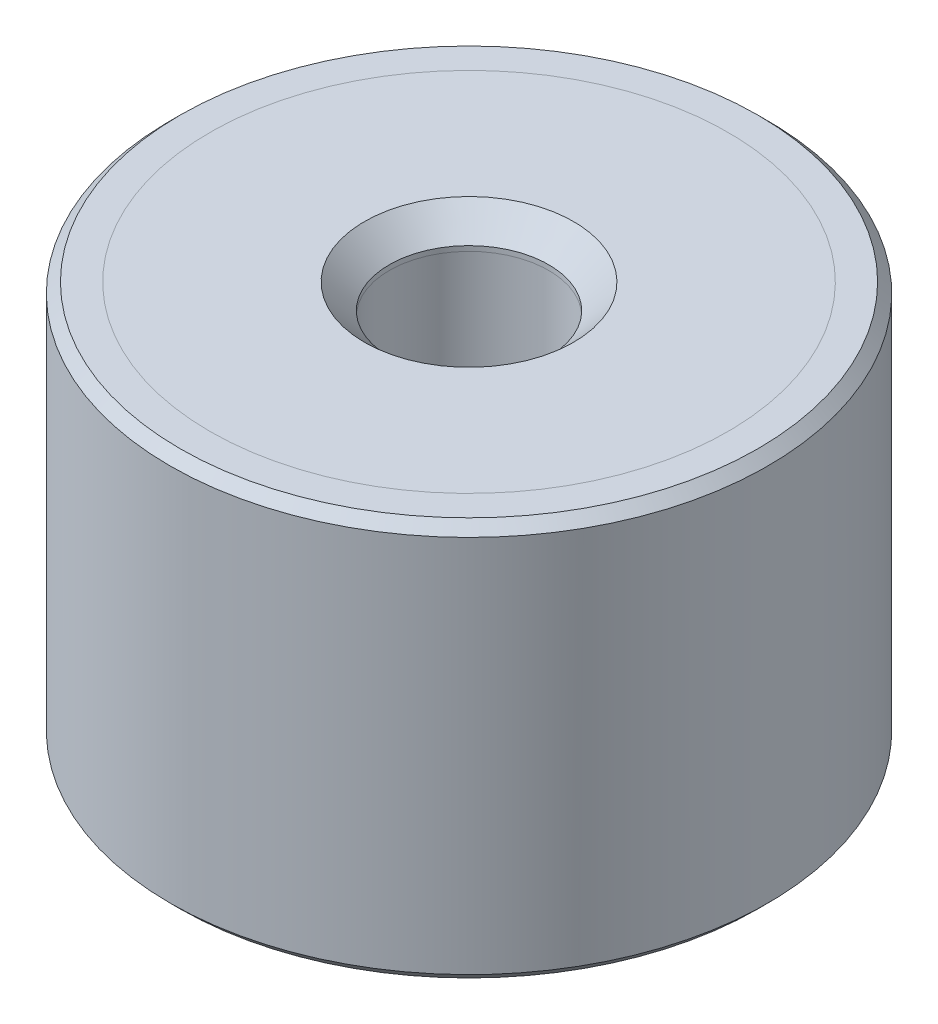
ISO-10303-21;
HEADER;
FILE_DESCRIPTION(('STEP AP214'),'2;1');
FILE_NAME('part.step','',(''),(''),'','','');
FILE_SCHEMA(('AUTOMOTIVE_DESIGN { 1 0 10303 214 1 1 1 1 }'));
ENDSEC;
DATA;
#1=APPLICATION_CONTEXT('core data for automotive mechanical design processes');
#2=APPLICATION_PROTOCOL_DEFINITION('international standard','automotive_design',2000,#1);
#3=PRODUCT_CONTEXT('',#1,'mechanical');
#4=PRODUCT('Part','Part','',(#3));
#5=PRODUCT_RELATED_PRODUCT_CATEGORY('part','',(#4));
#6=PRODUCT_DEFINITION_FORMATION('','',#4);
#7=PRODUCT_DEFINITION_CONTEXT('part definition',#1,'design');
#8=PRODUCT_DEFINITION('design','',#6,#7);
#9=PRODUCT_DEFINITION_SHAPE('','',#8);
#10=(LENGTH_UNIT() NAMED_UNIT(*) SI_UNIT(.MILLI.,.METRE.));
#11=(NAMED_UNIT(*) PLANE_ANGLE_UNIT() SI_UNIT($,.RADIAN.));
#12=(NAMED_UNIT(*) SI_UNIT($,.STERADIAN.) SOLID_ANGLE_UNIT());
#13=UNCERTAINTY_MEASURE_WITH_UNIT(LENGTH_MEASURE(1.E-05),#10,'distance_accuracy_value','');
#14=(GEOMETRIC_REPRESENTATION_CONTEXT(3) GLOBAL_UNCERTAINTY_ASSIGNED_CONTEXT((#13)) GLOBAL_UNIT_ASSIGNED_CONTEXT((#10,
#11,#12)) REPRESENTATION_CONTEXT('',''));
#15=CARTESIAN_POINT('',(0.,0.,0.));
#16=DIRECTION('',(0.,0.,1.));
#17=DIRECTION('',(1.,0.,0.));
#18=AXIS2_PLACEMENT_3D('',#15,#16,#17);
#19=CARTESIAN_POINT('',(0.,51.0340428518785,0.));
#20=DIRECTION('',(0.,1.,0.));
#21=DIRECTION('',(0.,0.,1.));
#22=AXIS2_PLACEMENT_3D('',#19,#20,#21);
#23=CYLINDRICAL_SURFACE('',#22,4.);
#24=CARTESIAN_POINT('',(0.,-17.25,0.));
#25=DIRECTION('',(0.,-1.,0.));
#26=DIRECTION('',(0.,0.,-1.));
#27=AXIS2_PLACEMENT_3D('',#24,#25,#26);
#28=CIRCLE('',#27,4.);
#29=CARTESIAN_POINT('',(0.,-17.25,-4.));
#30=VERTEX_POINT('',#29);
#31=EDGE_CURVE('P0_E10',#30,#30,#28,.T.);
#32=ORIENTED_EDGE('',*,*,#31,.T.);
#33=EDGE_LOOP('',(#32));
#34=FACE_BOUND('',#33,.T.);
#35=CARTESIAN_POINT('',(0.,-17.,0.));
#36=DIRECTION('',(0.,1.,0.));
#37=DIRECTION('',(0.,0.,1.));
#38=AXIS2_PLACEMENT_3D('',#35,#36,#37);
#39=CIRCLE('',#38,4.);
#40=CARTESIAN_POINT('',(0.,-17.,4.));
#41=VERTEX_POINT('',#40);
#42=EDGE_CURVE('P0_E25',#41,#41,#39,.T.);
#43=ORIENTED_EDGE('',*,*,#42,.T.);
#44=EDGE_LOOP('',(#43));
#45=FACE_BOUND('',#44,.T.);
#46=ADVANCED_FACE('P0_F14',(#34,#45),#23,.F.);
#47=CARTESIAN_POINT('',(0.,-17.,4.));
#48=DIRECTION('',(0.,1.,0.));
#49=DIRECTION('',(0.,0.,1.));
#50=AXIS2_PLACEMENT_3D('',#47,#48,#49);
#51=PLANE('',#50);
#52=CARTESIAN_POINT('',(0.,-17.,0.));
#53=DIRECTION('',(0.,1.,0.));
#54=DIRECTION('',(0.,0.,1.));
#55=AXIS2_PLACEMENT_3D('',#52,#53,#54);
#56=CIRCLE('',#55,13.);
#57=CARTESIAN_POINT('',(0.,-17.,13.));
#58=VERTEX_POINT('',#57);
#59=EDGE_CURVE('P0_E29',#58,#58,#56,.T.);
#60=ORIENTED_EDGE('',*,*,#59,.T.);
#61=EDGE_LOOP('',(#60));
#62=FACE_BOUND('',#61,.T.);
#63=ORIENTED_EDGE('',*,*,#42,.F.);
#64=EDGE_LOOP('',(#63));
#65=FACE_BOUND('',#64,.T.);
#66=ADVANCED_FACE('P0_F50',(#62,#65),#51,.T.);
#67=CARTESIAN_POINT('',(0.,51.0340428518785,0.));
#68=DIRECTION('',(0.,1.,0.));
#69=DIRECTION('',(0.,0.,1.));
#70=AXIS2_PLACEMENT_3D('',#67,#68,#69);
#71=CYLINDRICAL_SURFACE('',#70,13.);
#72=CARTESIAN_POINT('',(0.,-18.5,0.));
#73=DIRECTION('',(0.,1.,0.));
#74=DIRECTION('',(0.,0.,1.));
#75=AXIS2_PLACEMENT_3D('',#72,#73,#74);
#76=CIRCLE('',#75,13.);
#77=CARTESIAN_POINT('',(0.,-18.5,13.));
#78=VERTEX_POINT('',#77);
#79=EDGE_CURVE('P0_E34',#78,#78,#76,.T.);
#80=ORIENTED_EDGE('',*,*,#79,.T.);
#81=EDGE_LOOP('',(#80));
#82=FACE_BOUND('',#81,.T.);
#83=ORIENTED_EDGE('',*,*,#59,.F.);
#84=EDGE_LOOP('',(#83));
#85=FACE_BOUND('',#84,.T.);
#86=ADVANCED_FACE('P0_F38',(#82,#85),#71,.T.);
#87=CARTESIAN_POINT('',(0.,-18.5,13.));
#88=DIRECTION('',(0.,-1.,0.));
#89=DIRECTION('',(0.,0.,-1.));
#90=AXIS2_PLACEMENT_3D('',#87,#88,#89);
#91=PLANE('',#90);
#92=CARTESIAN_POINT('',(0.,-18.5,0.));
#93=DIRECTION('',(0.,-1.,0.));
#94=DIRECTION('',(0.,0.,-1.));
#95=AXIS2_PLACEMENT_3D('',#92,#93,#94);
#96=CIRCLE('',#95,5.25);
#97=CARTESIAN_POINT('',(0.,-18.5,-5.25));
#98=VERTEX_POINT('',#97);
#99=EDGE_CURVE('P0_E21',#98,#98,#96,.F.);
#100=ORIENTED_EDGE('',*,*,#99,.T.);
#101=EDGE_LOOP('',(#100));
#102=FACE_BOUND('',#101,.T.);
#103=ORIENTED_EDGE('',*,*,#79,.F.);
#104=EDGE_LOOP('',(#103));
#105=FACE_BOUND('',#104,.T.);
#106=ADVANCED_FACE('P0_F41',(#102,#105),#91,.T.);
#107=CARTESIAN_POINT('',(0.,-18.5,0.));
#108=DIRECTION('',(0.,-1.,0.));
#109=DIRECTION('',(0.,0.,-1.));
#110=AXIS2_PLACEMENT_3D('',#107,#108,#109);
#111=CONICAL_SURFACE('',#110,5.25,0.785398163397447);
#112=ORIENTED_EDGE('',*,*,#31,.F.);
#113=EDGE_LOOP('',(#112));
#114=FACE_BOUND('',#113,.T.);
#115=ORIENTED_EDGE('',*,*,#99,.F.);
#116=EDGE_LOOP('',(#115));
#117=FACE_BOUND('',#116,.T.);
#118=ADVANCED_FACE('P0_F16',(#114,#117),#111,.F.);
#119=CLOSED_SHELL('',(#46,#66,#86,#106,#118));
#120=MANIFOLD_SOLID_BREP('P0_B1',#119);
#121=CARTESIAN_POINT('',(0.,69.5340428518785,0.));
#122=DIRECTION('',(0.,1.,0.));
#123=DIRECTION('',(0.,0.,1.));
#124=AXIS2_PLACEMENT_3D('',#121,#122,#123);
#125=CYLINDRICAL_SURFACE('',#124,4.);
#126=CARTESIAN_POINT('',(0.,0.249999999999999,0.));
#127=DIRECTION('',(0.,1.,0.));
#128=DIRECTION('',(0.,0.,1.));
#129=AXIS2_PLACEMENT_3D('',#126,#127,#128);
#130=CIRCLE('',#129,4.);
#131=CARTESIAN_POINT('',(0.,0.249999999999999,4.));
#132=VERTEX_POINT('',#131);
#133=EDGE_CURVE('P1_E21',#132,#132,#130,.T.);
#134=ORIENTED_EDGE('',*,*,#133,.T.);
#135=EDGE_LOOP('',(#134));
#136=FACE_BOUND('',#135,.T.);
#137=CARTESIAN_POINT('',(0.,0.,0.));
#138=DIRECTION('',(0.,1.,0.));
#139=DIRECTION('',(0.,0.,1.));
#140=AXIS2_PLACEMENT_3D('',#137,#138,#139);
#141=CIRCLE('',#140,4.);
#142=CARTESIAN_POINT('',(0.,0.,4.));
#143=VERTEX_POINT('',#142);
#144=EDGE_CURVE('P1_E34',#143,#143,#141,.T.);
#145=ORIENTED_EDGE('',*,*,#144,.F.);
#146=EDGE_LOOP('',(#145));
#147=FACE_BOUND('',#146,.T.);
#148=ADVANCED_FACE('P1_F14',(#136,#147),#125,.F.);
#149=CARTESIAN_POINT('',(0.,1.5,4.));
#150=DIRECTION('',(0.,1.,0.));
#151=DIRECTION('',(0.,0.,1.));
#152=AXIS2_PLACEMENT_3D('',#149,#150,#151);
#153=PLANE('',#152);
#154=CARTESIAN_POINT('',(0.,1.5,0.));
#155=DIRECTION('',(0.,1.,0.));
#156=DIRECTION('',(0.,0.,1.));
#157=AXIS2_PLACEMENT_3D('',#154,#155,#156);
#158=CIRCLE('',#157,5.25);
#159=CARTESIAN_POINT('',(0.,1.5,5.25));
#160=VERTEX_POINT('',#159);
#161=EDGE_CURVE('P1_E10',#160,#160,#158,.F.);
#162=ORIENTED_EDGE('',*,*,#161,.T.);
#163=EDGE_LOOP('',(#162));
#164=FACE_BOUND('',#163,.T.);
#165=CARTESIAN_POINT('',(0.,1.5,0.));
#166=DIRECTION('',(0.,1.,0.));
#167=DIRECTION('',(0.,0.,1.));
#168=AXIS2_PLACEMENT_3D('',#165,#166,#167);
#169=CIRCLE('',#168,13.);
#170=CARTESIAN_POINT('',(0.,1.5,13.));
#171=VERTEX_POINT('',#170);
#172=EDGE_CURVE('P1_E25',#171,#171,#169,.T.);
#173=ORIENTED_EDGE('',*,*,#172,.T.);
#174=EDGE_LOOP('',(#173));
#175=FACE_BOUND('',#174,.T.);
#176=ADVANCED_FACE('P1_F42',(#164,#175),#153,.T.);
#177=CARTESIAN_POINT('',(0.,69.5340428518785,0.));
#178=DIRECTION('',(0.,1.,0.));
#179=DIRECTION('',(0.,0.,1.));
#180=AXIS2_PLACEMENT_3D('',#177,#178,#179);
#181=CYLINDRICAL_SURFACE('',#180,13.);
#182=CARTESIAN_POINT('',(0.,0.,0.));
#183=DIRECTION('',(0.,1.,0.));
#184=DIRECTION('',(0.,0.,1.));
#185=AXIS2_PLACEMENT_3D('',#182,#183,#184);
#186=CIRCLE('',#185,13.);
#187=CARTESIAN_POINT('',(0.,0.,13.));
#188=VERTEX_POINT('',#187);
#189=EDGE_CURVE('P1_E29',#188,#188,#186,.T.);
#190=ORIENTED_EDGE('',*,*,#189,.T.);
#191=EDGE_LOOP('',(#190));
#192=FACE_BOUND('',#191,.T.);
#193=ORIENTED_EDGE('',*,*,#172,.F.);
#194=EDGE_LOOP('',(#193));
#195=FACE_BOUND('',#194,.T.);
#196=ADVANCED_FACE('P1_F47',(#192,#195),#181,.T.);
#197=CARTESIAN_POINT('',(0.,0.,13.));
#198=DIRECTION('',(0.,-1.,0.));
#199=DIRECTION('',(0.,0.,-1.));
#200=AXIS2_PLACEMENT_3D('',#197,#198,#199);
#201=PLANE('',#200);
#202=ORIENTED_EDGE('',*,*,#144,.T.);
#203=EDGE_LOOP('',(#202));
#204=FACE_BOUND('',#203,.T.);
#205=ORIENTED_EDGE('',*,*,#189,.F.);
#206=EDGE_LOOP('',(#205));
#207=FACE_BOUND('',#206,.T.);
#208=ADVANCED_FACE('P1_F38',(#204,#207),#201,.T.);
#209=CARTESIAN_POINT('',(0.,0.249999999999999,0.));
#210=DIRECTION('',(0.,1.,0.));
#211=DIRECTION('',(0.,0.,1.));
#212=AXIS2_PLACEMENT_3D('',#209,#210,#211);
#213=CONICAL_SURFACE('',#212,4.,0.785398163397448);
#214=ORIENTED_EDGE('',*,*,#161,.F.);
#215=EDGE_LOOP('',(#214));
#216=FACE_BOUND('',#215,.T.);
#217=ORIENTED_EDGE('',*,*,#133,.F.);
#218=EDGE_LOOP('',(#217));
#219=FACE_BOUND('',#218,.T.);
#220=ADVANCED_FACE('P1_F16',(#216,#219),#213,.F.);
#221=CLOSED_SHELL('',(#148,#176,#196,#208,#220));
#222=MANIFOLD_SOLID_BREP('P1_B1',#221);
#223=CARTESIAN_POINT('',(0.,0.,0.));
#224=DIRECTION('',(0.,1.,0.));
#225=DIRECTION('',(0.,0.,1.));
#226=AXIS2_PLACEMENT_3D('',#223,#224,#225);
#227=PLANE('',#226);
#228=CARTESIAN_POINT('',(0.,0.,0.));
#229=DIRECTION('',(0.,1.,0.));
#230=DIRECTION('',(0.,0.,1.));
#231=AXIS2_PLACEMENT_3D('',#228,#229,#230);
#232=CIRCLE('',#231,4.);
#233=CARTESIAN_POINT('',(0.,0.,4.));
#234=VERTEX_POINT('',#233);
#235=EDGE_CURVE('P2_E46',#234,#234,#232,.T.);
#236=ORIENTED_EDGE('',*,*,#235,.F.);
#237=EDGE_LOOP('',(#236));
#238=FACE_BOUND('',#237,.T.);
#239=CARTESIAN_POINT('',(0.,0.,0.));
#240=DIRECTION('',(0.,1.,0.));
#241=DIRECTION('',(0.,0.,1.));
#242=AXIS2_PLACEMENT_3D('',#239,#240,#241);
#243=CIRCLE('',#242,13.);
#244=CARTESIAN_POINT('',(0.,0.,13.));
#245=VERTEX_POINT('',#244);
#246=EDGE_CURVE('P2_E33',#245,#245,#243,.T.);
#247=ORIENTED_EDGE('',*,*,#246,.T.);
#248=EDGE_LOOP('',(#247));
#249=FACE_BOUND('',#248,.T.);
#250=ADVANCED_FACE('P2_F13',(#238,#249),#227,.T.);
#251=CARTESIAN_POINT('',(0.,65.5134936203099,0.));
#252=DIRECTION('',(0.,1.,0.));
#253=DIRECTION('',(0.,0.,1.));
#254=AXIS2_PLACEMENT_3D('',#251,#252,#253);
#255=CYLINDRICAL_SURFACE('',#254,13.);
#256=CARTESIAN_POINT('',(0.,1.5,0.));
#257=DIRECTION('',(0.,1.,0.));
#258=DIRECTION('',(0.,0.,1.));
#259=AXIS2_PLACEMENT_3D('',#256,#257,#258);
#260=CIRCLE('',#259,13.);
#261=CARTESIAN_POINT('',(0.,1.5,13.));
#262=VERTEX_POINT('',#261);
#263=EDGE_CURVE('P2_E36',#262,#262,#260,.T.);
#264=ORIENTED_EDGE('',*,*,#263,.T.);
#265=EDGE_LOOP('',(#264));
#266=FACE_BOUND('',#265,.T.);
#267=ORIENTED_EDGE('',*,*,#246,.F.);
#268=EDGE_LOOP('',(#267));
#269=FACE_BOUND('',#268,.T.);
#270=ADVANCED_FACE('P2_F92',(#266,#269),#255,.F.);
#271=CARTESIAN_POINT('',(0.,1.5,13.));
#272=DIRECTION('',(0.,1.,0.));
#273=DIRECTION('',(0.,0.,1.));
#274=AXIS2_PLACEMENT_3D('',#271,#272,#273);
#275=PLANE('',#274);
#276=CARTESIAN_POINT('',(0.,1.5,0.));
#277=DIRECTION('',(0.,1.,0.));
#278=DIRECTION('',(0.,0.,1.));
#279=AXIS2_PLACEMENT_3D('',#276,#277,#278);
#280=CIRCLE('',#279,14.5);
#281=CARTESIAN_POINT('',(0.,1.5,14.5));
#282=VERTEX_POINT('',#281);
#283=EDGE_CURVE('P2_E9',#282,#282,#280,.T.);
#284=ORIENTED_EDGE('',*,*,#283,.T.);
#285=EDGE_LOOP('',(#284));
#286=FACE_BOUND('',#285,.T.);
#287=ORIENTED_EDGE('',*,*,#263,.F.);
#288=EDGE_LOOP('',(#287));
#289=FACE_BOUND('',#288,.T.);
#290=ADVANCED_FACE('P2_F88',(#286,#289),#275,.T.);
#291=CARTESIAN_POINT('',(0.,65.5134936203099,0.));
#292=DIRECTION('',(0.,1.,0.));
#293=DIRECTION('',(0.,0.,1.));
#294=AXIS2_PLACEMENT_3D('',#291,#292,#293);
#295=CYLINDRICAL_SURFACE('',#294,15.);
#296=CARTESIAN_POINT('',(0.,-18.,0.));
#297=DIRECTION('',(0.,-1.,0.));
#298=DIRECTION('',(0.,0.,-1.));
#299=AXIS2_PLACEMENT_3D('',#296,#297,#298);
#300=CIRCLE('',#299,15.);
#301=CARTESIAN_POINT('',(0.,-18.,-15.));
#302=VERTEX_POINT('',#301);
#303=EDGE_CURVE('P2_E24',#302,#302,#300,.F.);
#304=ORIENTED_EDGE('',*,*,#303,.T.);
#305=EDGE_LOOP('',(#304));
#306=FACE_BOUND('',#305,.T.);
#307=CARTESIAN_POINT('',(0.,1.,0.));
#308=DIRECTION('',(0.,1.,0.));
#309=DIRECTION('',(0.,0.,1.));
#310=AXIS2_PLACEMENT_3D('',#307,#308,#309);
#311=CIRCLE('',#310,15.);
#312=CARTESIAN_POINT('',(0.,1.,15.));
#313=VERTEX_POINT('',#312);
#314=EDGE_CURVE('P2_E28',#313,#313,#311,.F.);
#315=ORIENTED_EDGE('',*,*,#314,.T.);
#316=EDGE_LOOP('',(#315));
#317=FACE_BOUND('',#316,.T.);
#318=ADVANCED_FACE('P2_F82',(#306,#317),#295,.T.);
#319=CARTESIAN_POINT('',(0.,-18.5,15.));
#320=DIRECTION('',(0.,-1.,0.));
#321=DIRECTION('',(0.,0.,-1.));
#322=AXIS2_PLACEMENT_3D('',#319,#320,#321);
#323=PLANE('',#322);
#324=CARTESIAN_POINT('',(0.,-18.5,0.));
#325=DIRECTION('',(0.,-1.,0.));
#326=DIRECTION('',(0.,0.,-1.));
#327=AXIS2_PLACEMENT_3D('',#324,#325,#326);
#328=CIRCLE('',#327,14.5);
#329=CARTESIAN_POINT('',(0.,-18.5,-14.5));
#330=VERTEX_POINT('',#329);
#331=EDGE_CURVE('P2_E20',#330,#330,#328,.T.);
#332=ORIENTED_EDGE('',*,*,#331,.T.);
#333=EDGE_LOOP('',(#332));
#334=FACE_BOUND('',#333,.T.);
#335=CARTESIAN_POINT('',(0.,-18.5,0.));
#336=DIRECTION('',(0.,1.,0.));
#337=DIRECTION('',(0.,0.,1.));
#338=AXIS2_PLACEMENT_3D('',#335,#336,#337);
#339=CIRCLE('',#338,13.);
#340=CARTESIAN_POINT('',(0.,-18.5,13.));
#341=VERTEX_POINT('',#340);
#342=EDGE_CURVE('P2_E39',#341,#341,#339,.T.);
#343=ORIENTED_EDGE('',*,*,#342,.T.);
#344=EDGE_LOOP('',(#343));
#345=FACE_BOUND('',#344,.T.);
#346=ADVANCED_FACE('P2_F77',(#334,#345),#323,.T.);
#347=CARTESIAN_POINT('',(0.,65.5134936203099,0.));
#348=DIRECTION('',(0.,1.,0.));
#349=DIRECTION('',(0.,0.,1.));
#350=AXIS2_PLACEMENT_3D('',#347,#348,#349);
#351=CYLINDRICAL_SURFACE('',#350,13.);
#352=CARTESIAN_POINT('',(0.,-17.,0.));
#353=DIRECTION('',(0.,1.,0.));
#354=DIRECTION('',(0.,0.,1.));
#355=AXIS2_PLACEMENT_3D('',#352,#353,#354);
#356=CIRCLE('',#355,13.);
#357=CARTESIAN_POINT('',(0.,-17.,13.));
#358=VERTEX_POINT('',#357);
#359=EDGE_CURVE('P2_E42',#358,#358,#356,.T.);
#360=ORIENTED_EDGE('',*,*,#359,.T.);
#361=EDGE_LOOP('',(#360));
#362=FACE_BOUND('',#361,.T.);
#363=ORIENTED_EDGE('',*,*,#342,.F.);
#364=EDGE_LOOP('',(#363));
#365=FACE_BOUND('',#364,.T.);
#366=ADVANCED_FACE('P2_F71',(#362,#365),#351,.F.);
#367=CARTESIAN_POINT('',(0.,-17.,13.));
#368=DIRECTION('',(0.,-1.,0.));
#369=DIRECTION('',(0.,0.,-1.));
#370=AXIS2_PLACEMENT_3D('',#367,#368,#369);
#371=PLANE('',#370);
#372=CARTESIAN_POINT('',(0.,-17.,0.));
#373=DIRECTION('',(0.,-1.,0.));
#374=DIRECTION('',(0.,0.,-1.));
#375=AXIS2_PLACEMENT_3D('',#372,#373,#374);
#376=CIRCLE('',#375,4.);
#377=CARTESIAN_POINT('',(0.,-17.,-4.));
#378=VERTEX_POINT('',#377);
#379=EDGE_CURVE('P2_E52',#378,#378,#376,.T.);
#380=ORIENTED_EDGE('',*,*,#379,.F.);
#381=EDGE_LOOP('',(#380));
#382=FACE_BOUND('',#381,.T.);
#383=ORIENTED_EDGE('',*,*,#359,.F.);
#384=EDGE_LOOP('',(#383));
#385=FACE_BOUND('',#384,.T.);
#386=ADVANCED_FACE('P2_F67',(#382,#385),#371,.T.);
#387=CARTESIAN_POINT('',(0.,-18.,0.));
#388=DIRECTION('',(0.,1.,0.));
#389=DIRECTION('',(0.,0.,1.));
#390=AXIS2_PLACEMENT_3D('',#387,#388,#389);
#391=CONICAL_SURFACE('',#390,15.,0.785398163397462);
#392=ORIENTED_EDGE('',*,*,#331,.F.);
#393=EDGE_LOOP('',(#392));
#394=FACE_BOUND('',#393,.T.);
#395=ORIENTED_EDGE('',*,*,#303,.F.);
#396=EDGE_LOOP('',(#395));
#397=FACE_BOUND('',#396,.T.);
#398=ADVANCED_FACE('P2_F70',(#394,#397),#391,.T.);
#399=CARTESIAN_POINT('',(0.,1.5,0.));
#400=DIRECTION('',(0.,-1.,0.));
#401=DIRECTION('',(0.,0.,-1.));
#402=AXIS2_PLACEMENT_3D('',#399,#400,#401);
#403=CONICAL_SURFACE('',#402,14.5,0.785398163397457);
#404=ORIENTED_EDGE('',*,*,#314,.F.);
#405=EDGE_LOOP('',(#404));
#406=FACE_BOUND('',#405,.T.);
#407=ORIENTED_EDGE('',*,*,#283,.F.);
#408=EDGE_LOOP('',(#407));
#409=FACE_BOUND('',#408,.T.);
#410=ADVANCED_FACE('P2_F15',(#406,#409),#403,.T.);
#411=CARTESIAN_POINT('',(0.,-6.5,0.));
#412=DIRECTION('',(0.,1.,0.));
#413=DIRECTION('',(0.,0.,1.));
#414=AXIS2_PLACEMENT_3D('',#411,#412,#413);
#415=CYLINDRICAL_SURFACE('',#414,4.);
#416=CARTESIAN_POINT('',(0.,-6.5,0.));
#417=DIRECTION('',(0.,1.,0.));
#418=DIRECTION('',(0.,0.,1.));
#419=AXIS2_PLACEMENT_3D('',#416,#417,#418);
#420=CIRCLE('',#419,4.);
#421=CARTESIAN_POINT('',(0.,-6.5,4.));
#422=VERTEX_POINT('',#421);
#423=EDGE_CURVE('P2_E45',#422,#422,#420,.T.);
#424=CARTESIAN_POINT('',(0.,-6.5,4.));
#425=CARTESIAN_POINT('',(0.,-6.43229166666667,4.));
#426=CARTESIAN_POINT('',(0.,-6.36458333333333,4.));
#427=CARTESIAN_POINT('',(0.,-6.22916666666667,4.));
#428=CARTESIAN_POINT('',(0.,-6.16145833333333,4.));
#429=CARTESIAN_POINT('',(0.,-6.02604166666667,4.));
#430=CARTESIAN_POINT('',(0.,-5.95833333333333,4.));
#431=CARTESIAN_POINT('',(0.,-5.82291666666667,4.));
#432=CARTESIAN_POINT('',(0.,-5.75520833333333,4.));
#433=CARTESIAN_POINT('',(0.,-5.61979166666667,4.));
#434=CARTESIAN_POINT('',(0.,-5.55208333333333,4.));
#435=CARTESIAN_POINT('',(0.,-5.41666666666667,4.));
#436=CARTESIAN_POINT('',(0.,-5.34895833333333,4.));
#437=CARTESIAN_POINT('',(0.,-5.21354166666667,4.));
#438=CARTESIAN_POINT('',(0.,-5.14583333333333,4.));
#439=CARTESIAN_POINT('',(0.,-5.01041666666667,4.));
#440=CARTESIAN_POINT('',(0.,-4.94270833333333,4.));
#441=CARTESIAN_POINT('',(0.,-4.80729166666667,4.));
#442=CARTESIAN_POINT('',(0.,-4.73958333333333,4.));
#443=CARTESIAN_POINT('',(0.,-4.60416666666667,4.));
#444=CARTESIAN_POINT('',(0.,-4.53645833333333,4.));
#445=CARTESIAN_POINT('',(0.,-4.40104166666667,4.));
#446=CARTESIAN_POINT('',(0.,-4.33333333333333,4.));
#447=CARTESIAN_POINT('',(0.,-4.19791666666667,4.));
#448=CARTESIAN_POINT('',(0.,-4.13020833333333,4.));
#449=CARTESIAN_POINT('',(0.,-3.99479166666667,4.));
#450=CARTESIAN_POINT('',(0.,-3.92708333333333,4.));
#451=CARTESIAN_POINT('',(0.,-3.79166666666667,4.));
#452=CARTESIAN_POINT('',(0.,-3.72395833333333,4.));
#453=CARTESIAN_POINT('',(0.,-3.58854166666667,4.));
#454=CARTESIAN_POINT('',(0.,-3.52083333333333,4.));
#455=CARTESIAN_POINT('',(0.,-3.38541666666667,4.));
#456=CARTESIAN_POINT('',(0.,-3.31770833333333,4.));
#457=CARTESIAN_POINT('',(0.,-3.18229166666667,4.));
#458=CARTESIAN_POINT('',(0.,-3.11458333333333,4.));
#459=CARTESIAN_POINT('',(0.,-2.97916666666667,4.));
#460=CARTESIAN_POINT('',(0.,-2.91145833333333,4.));
#461=CARTESIAN_POINT('',(0.,-2.77604166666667,4.));
#462=CARTESIAN_POINT('',(0.,-2.70833333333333,4.));
#463=CARTESIAN_POINT('',(0.,-2.57291666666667,4.));
#464=CARTESIAN_POINT('',(0.,-2.50520833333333,4.));
#465=CARTESIAN_POINT('',(0.,-2.36979166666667,4.));
#466=CARTESIAN_POINT('',(0.,-2.30208333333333,4.));
#467=CARTESIAN_POINT('',(0.,-2.16666666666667,4.));
#468=CARTESIAN_POINT('',(0.,-2.09895833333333,4.));
#469=CARTESIAN_POINT('',(0.,-1.96354166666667,4.));
#470=CARTESIAN_POINT('',(0.,-1.89583333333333,4.));
#471=CARTESIAN_POINT('',(0.,-1.76041666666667,4.));
#472=CARTESIAN_POINT('',(0.,-1.69270833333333,4.));
#473=CARTESIAN_POINT('',(0.,-1.55729166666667,4.));
#474=CARTESIAN_POINT('',(0.,-1.48958333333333,4.));
#475=CARTESIAN_POINT('',(0.,-1.35416666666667,4.));
#476=CARTESIAN_POINT('',(0.,-1.28645833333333,4.));
#477=CARTESIAN_POINT('',(0.,-1.15104166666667,4.));
#478=CARTESIAN_POINT('',(0.,-1.08333333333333,4.));
#479=CARTESIAN_POINT('',(0.,-0.947916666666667,4.));
#480=CARTESIAN_POINT('',(0.,-0.880208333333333,4.));
#481=CARTESIAN_POINT('',(0.,-0.744791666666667,4.));
#482=CARTESIAN_POINT('',(0.,-0.677083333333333,4.));
#483=CARTESIAN_POINT('',(0.,-0.541666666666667,4.));
#484=CARTESIAN_POINT('',(0.,-0.473958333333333,4.));
#485=CARTESIAN_POINT('',(0.,-0.338541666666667,4.));
#486=CARTESIAN_POINT('',(0.,-0.270833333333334,4.));
#487=CARTESIAN_POINT('',(0.,-0.135416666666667,4.));
#488=CARTESIAN_POINT('',(0.,-0.0677083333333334,4.));
#489=CARTESIAN_POINT('',(0.,0.,4.));
#490=B_SPLINE_CURVE_WITH_KNOTS('',3,(#424,#425,#426,#427,#428,#429,#430,#431,#432,#433,#434,
#435,#436,#437,#438,#439,#440,#441,#442,#443,#444,#445,#446,#447,#448,#449,#450,#451,#452,#453,
#454,#455,#456,#457,#458,#459,#460,#461,#462,#463,#464,#465,#466,#467,#468,#469,#470,#471,#472,
#473,#474,#475,#476,#477,#478,#479,#480,#481,#482,#483,#484,#485,#486,#487,#488,#489),
.UNSPECIFIED.,.F.,.F.,(4,2,2,2,2,2,2,2,2,2,2,2,2,2,2,2,2,2,2,2,2,2,2,2,2,2,2,2,2,2,2,2,4),(0.,
0.203124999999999,0.40625,0.609375,0.8125,1.015625,1.21875,1.421875,1.625,1.828125,2.03125,
2.234375,2.4375,2.640625,2.84375,3.046875,3.25,3.453125,3.65625,3.859375,4.0625,4.265625,
4.46875,4.671875,4.875,5.078125,5.28125,5.484375,5.6875,5.890625,6.09375,6.296875,6.5),.UNSPECIFIED.);
#491=EDGE_CURVE('P2_BSEAM108',#422,#234,#490,.T.);
#492=ORIENTED_EDGE('',*,*,#423,.F.);
#493=ORIENTED_EDGE('',*,*,#235,.T.);
#494=ORIENTED_EDGE('',*,*,#491,.T.);
#495=ORIENTED_EDGE('',*,*,#491,.F.);
#496=EDGE_LOOP('',(#492,#494,#493,#495));
#497=FACE_BOUND('',#496,.T.);
#498=ADVANCED_FACE('P2_F108',(#497),#415,.F.);
#499=CARTESIAN_POINT('',(0.,-6.5,0.));
#500=DIRECTION('',(0.,1.,0.));
#501=DIRECTION('',(0.,0.,1.));
#502=AXIS2_PLACEMENT_3D('',#499,#500,#501);
#503=PLANE('',#502);
#504=ORIENTED_EDGE('',*,*,#423,.T.);
#505=EDGE_LOOP('',(#504));
#506=FACE_BOUND('',#505,.T.);
#507=ADVANCED_FACE('P2_F63',(#506),#503,.T.);
#508=CARTESIAN_POINT('',(0.,-10.5,0.));
#509=DIRECTION('',(0.,-1.,0.));
#510=DIRECTION('',(0.,0.,-1.));
#511=AXIS2_PLACEMENT_3D('',#508,#509,#510);
#512=CYLINDRICAL_SURFACE('',#511,4.);
#513=CARTESIAN_POINT('',(0.,-10.5,0.));
#514=DIRECTION('',(0.,-1.,0.));
#515=DIRECTION('',(0.,0.,-1.));
#516=AXIS2_PLACEMENT_3D('',#513,#514,#515);
#517=CIRCLE('',#516,4.);
#518=CARTESIAN_POINT('',(0.,-10.5,-4.));
#519=VERTEX_POINT('',#518);
#520=EDGE_CURVE('P2_E49',#519,#519,#517,.T.);
#521=CARTESIAN_POINT('',(0.,-10.5,-4.));
#522=CARTESIAN_POINT('',(0.,-10.5677083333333,-4.));
#523=CARTESIAN_POINT('',(0.,-10.6354166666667,-4.));
#524=CARTESIAN_POINT('',(0.,-10.7708333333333,-4.));
#525=CARTESIAN_POINT('',(0.,-10.8385416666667,-4.));
#526=CARTESIAN_POINT('',(0.,-10.9739583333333,-4.));
#527=CARTESIAN_POINT('',(0.,-11.0416666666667,-4.));
#528=CARTESIAN_POINT('',(0.,-11.1770833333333,-4.));
#529=CARTESIAN_POINT('',(0.,-11.2447916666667,-4.));
#530=CARTESIAN_POINT('',(0.,-11.3802083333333,-4.));
#531=CARTESIAN_POINT('',(0.,-11.4479166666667,-4.));
#532=CARTESIAN_POINT('',(0.,-11.5833333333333,-4.));
#533=CARTESIAN_POINT('',(0.,-11.6510416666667,-4.));
#534=CARTESIAN_POINT('',(0.,-11.7864583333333,-4.));
#535=CARTESIAN_POINT('',(0.,-11.8541666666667,-4.));
#536=CARTESIAN_POINT('',(0.,-11.9895833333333,-4.));
#537=CARTESIAN_POINT('',(0.,-12.0572916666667,-4.));
#538=CARTESIAN_POINT('',(0.,-12.1927083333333,-4.));
#539=CARTESIAN_POINT('',(0.,-12.2604166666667,-4.));
#540=CARTESIAN_POINT('',(0.,-12.3958333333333,-4.));
#541=CARTESIAN_POINT('',(0.,-12.4635416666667,-4.));
#542=CARTESIAN_POINT('',(0.,-12.5989583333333,-4.));
#543=CARTESIAN_POINT('',(0.,-12.6666666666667,-4.));
#544=CARTESIAN_POINT('',(0.,-12.8020833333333,-4.));
#545=CARTESIAN_POINT('',(0.,-12.8697916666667,-4.));
#546=CARTESIAN_POINT('',(0.,-13.0052083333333,-4.));
#547=CARTESIAN_POINT('',(0.,-13.0729166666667,-4.));
#548=CARTESIAN_POINT('',(0.,-13.2083333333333,-4.));
#549=CARTESIAN_POINT('',(0.,-13.2760416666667,-4.));
#550=CARTESIAN_POINT('',(0.,-13.4114583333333,-4.));
#551=CARTESIAN_POINT('',(0.,-13.4791666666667,-4.));
#552=CARTESIAN_POINT('',(0.,-13.6145833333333,-4.));
#553=CARTESIAN_POINT('',(0.,-13.6822916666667,-4.));
#554=CARTESIAN_POINT('',(0.,-13.8177083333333,-4.));
#555=CARTESIAN_POINT('',(0.,-13.8854166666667,-4.));
#556=CARTESIAN_POINT('',(0.,-14.0208333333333,-4.));
#557=CARTESIAN_POINT('',(0.,-14.0885416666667,-4.));
#558=CARTESIAN_POINT('',(0.,-14.2239583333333,-4.));
#559=CARTESIAN_POINT('',(0.,-14.2916666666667,-4.));
#560=CARTESIAN_POINT('',(0.,-14.4270833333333,-4.));
#561=CARTESIAN_POINT('',(0.,-14.4947916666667,-4.));
#562=CARTESIAN_POINT('',(0.,-14.6302083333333,-4.));
#563=CARTESIAN_POINT('',(0.,-14.6979166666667,-4.));
#564=CARTESIAN_POINT('',(0.,-14.8333333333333,-4.));
#565=CARTESIAN_POINT('',(0.,-14.9010416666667,-4.));
#566=CARTESIAN_POINT('',(0.,-15.0364583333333,-4.));
#567=CARTESIAN_POINT('',(0.,-15.1041666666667,-4.));
#568=CARTESIAN_POINT('',(0.,-15.2395833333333,-4.));
#569=CARTESIAN_POINT('',(0.,-15.3072916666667,-4.));
#570=CARTESIAN_POINT('',(0.,-15.4427083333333,-4.));
#571=CARTESIAN_POINT('',(0.,-15.5104166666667,-4.));
#572=CARTESIAN_POINT('',(0.,-15.6458333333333,-4.));
#573=CARTESIAN_POINT('',(0.,-15.7135416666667,-4.));
#574=CARTESIAN_POINT('',(0.,-15.8489583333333,-4.));
#575=CARTESIAN_POINT('',(0.,-15.9166666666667,-4.));
#576=CARTESIAN_POINT('',(0.,-16.0520833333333,-4.));
#577=CARTESIAN_POINT('',(0.,-16.1197916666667,-4.));
#578=CARTESIAN_POINT('',(0.,-16.2552083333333,-4.));
#579=CARTESIAN_POINT('',(0.,-16.3229166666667,-4.));
#580=CARTESIAN_POINT('',(0.,-16.4583333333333,-4.));
#581=CARTESIAN_POINT('',(0.,-16.5260416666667,-4.));
#582=CARTESIAN_POINT('',(0.,-16.6614583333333,-4.));
#583=CARTESIAN_POINT('',(0.,-16.7291666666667,-4.));
#584=CARTESIAN_POINT('',(0.,-16.8645833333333,-4.));
#585=CARTESIAN_POINT('',(0.,-16.9322916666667,-4.));
#586=CARTESIAN_POINT('',(0.,-17.,-4.));
#587=B_SPLINE_CURVE_WITH_KNOTS('',3,(#521,#522,#523,#524,#525,#526,#527,#528,#529,#530,#531,
#532,#533,#534,#535,#536,#537,#538,#539,#540,#541,#542,#543,#544,#545,#546,#547,#548,#549,#550,
#551,#552,#553,#554,#555,#556,#557,#558,#559,#560,#561,#562,#563,#564,#565,#566,#567,#568,#569,
#570,#571,#572,#573,#574,#575,#576,#577,#578,#579,#580,#581,#582,#583,#584,#585,#586),
.UNSPECIFIED.,.F.,.F.,(4,2,2,2,2,2,2,2,2,2,2,2,2,2,2,2,2,2,2,2,2,2,2,2,2,2,2,2,2,2,2,2,4),(0.,
0.203124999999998,0.406249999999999,0.609374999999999,0.812499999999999,1.015625,1.21875,
1.421875,1.625,1.828125,2.03125,2.234375,2.4375,2.640625,2.84375,3.046875,3.25,3.453125,3.65625,
3.859375,4.0625,4.265625,4.46875,4.671875,4.875,5.078125,5.28125,5.484375,5.6875,5.890625,
6.09374999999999,6.296875,6.5),.UNSPECIFIED.);
#588=EDGE_CURVE('P2_BSEAM60',#519,#378,#587,.T.);
#589=ORIENTED_EDGE('',*,*,#520,.F.);
#590=ORIENTED_EDGE('',*,*,#379,.T.);
#591=ORIENTED_EDGE('',*,*,#588,.T.);
#592=ORIENTED_EDGE('',*,*,#588,.F.);
#593=EDGE_LOOP('',(#589,#591,#590,#592));
#594=FACE_BOUND('',#593,.T.);
#595=ADVANCED_FACE('P2_F60',(#594),#512,.F.);
#596=CARTESIAN_POINT('',(0.,-10.5,0.));
#597=DIRECTION('',(0.,-1.,0.));
#598=DIRECTION('',(0.,0.,-1.));
#599=AXIS2_PLACEMENT_3D('',#596,#597,#598);
#600=PLANE('',#599);
#601=ORIENTED_EDGE('',*,*,#520,.T.);
#602=EDGE_LOOP('',(#601));
#603=FACE_BOUND('',#602,.T.);
#604=ADVANCED_FACE('P2_F58',(#603),#600,.T.);
#605=CLOSED_SHELL('',(#250,#270,#290,#318,#346,#366,#386,#398,#410,#498,#507,#595,#604));
#606=MANIFOLD_SOLID_BREP('P2_B1',#605);
#607=ADVANCED_BREP_SHAPE_REPRESENTATION('',(#18,#120,#222,#606),#14);
#608=SHAPE_DEFINITION_REPRESENTATION(#9,#607);
ENDSEC;
END-ISO-10303-21;
